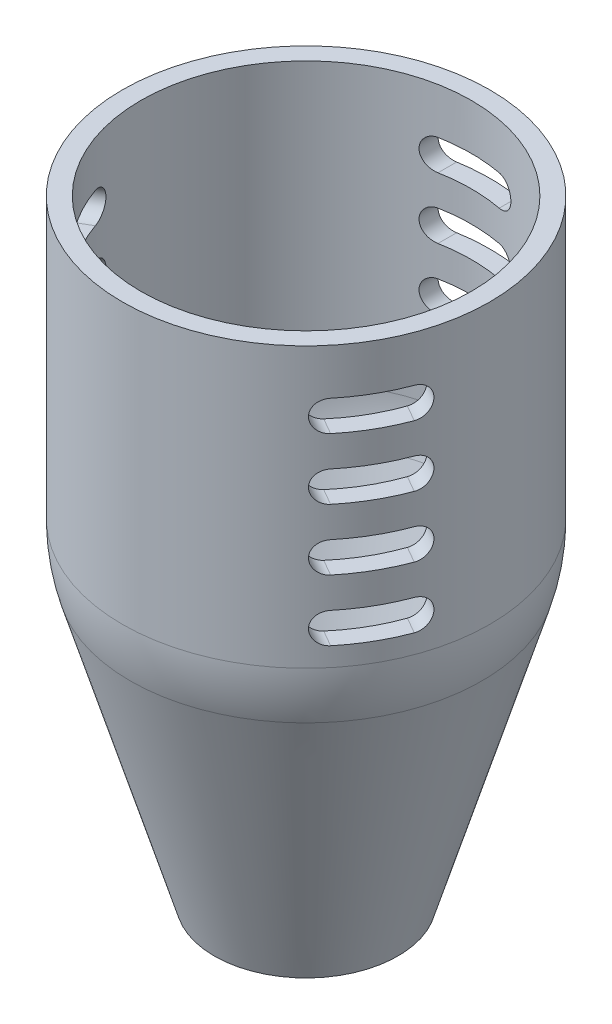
from build123d import *

# Parameters (mm, degrees)
VACIADO1_T            = -3
CORTAR_EXTRUIR1_DEPTH = 109.627804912
MATRIZL1_COUNT        = 4
MATRIZL1_PITCH        = 10
MATRIZC1_COUNT        = 3
MATRIZC1_COPY_1_DEPTH = 109.627804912
MATRIZC1_COPY_2_DEPTH = 109.627804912
MATRIZC1_COPY_3_DEPTH = 109.627804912
MATRIZC1_COPY_4_DEPTH = 109.627804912
MATRIZC1_COPY_5_DEPTH = 109.627804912
MATRIZC1_COPY_6_DEPTH = 109.627804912


with BuildPart() as part:
    # Croquis1 → Revoluci_n1 (revolve)
    with BuildSketch(Plane.XY, mode=Mode.PRIVATE) as revoluci_n1_sk:
        with BuildLine():
            Line((0, 0), (15, 0))
            Line((15, 0), (28.734788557, 45.782628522))
            ThreePointArc((28.734788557, 45.782628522), (29.682011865, 50.046670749), (30, 54.403065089))
            Line((30, 54.403065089), (30, 100))
            Line((30, 100), (0, 100))
            Line((0, 100), (0, 0))
        make_face()
    revolve(revoluci_n1_sk.sketch.rotate(Axis((0, 100, 0), (0, -1, 0)), 90), axis=Axis((0, 100, 0), (0, -1, 0)))

    # Vaciado1
    vaciado1_openings = [part.faces().sort_by_distance(p)[0] for p in [
        (0, 100, 0),
    ]]
    offset(amount=VACIADO1_T, openings=vaciado1_openings, kind=Kind.INTERSECTION)

    # Croquis2 → Cortar-Extruir1 (cut, through all)
    with BuildSketch(Plane.XY):
        with BuildLine():
            Line((-5, 62.5), (5, 62.5))
            ThreePointArc((5, 62.5), (7.5, 60), (5, 57.5))
            Line((5, 57.5), (-5, 57.5))
            ThreePointArc((-5, 57.5), (-7.5, 60), (-5, 62.5))
        make_face()
    cortar_extruir1 = extrude(amount=-CORTAR_EXTRUIR1_DEPTH, mode=Mode.SUBTRACT)

    # MatrizL1: Cortar-Extruir1 ×4
    with Locations(*[(0, i * MATRIZL1_PITCH, 0) for i in range(1, MATRIZL1_COUNT)]):
        add(cortar_extruir1, mode=Mode.SUBTRACT)

    # MatrizC1: Cortar-Extruir1 ×3 about axis
    matrizc1_axis = Axis((0, 100, 0), (0, 1, 0))
    for i in range(1, MATRIZC1_COUNT):
        add(cortar_extruir1.rotate(matrizc1_axis, i * 360 / MATRIZC1_COUNT), mode=Mode.SUBTRACT)

    # MatrizC1 copy 1 sketch → MatrizC1 copy 1 (cut, through all)
    with BuildSketch(Plane(origin=(0, 10, 0), x_dir=(-0.4999999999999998, 0, -0.8660254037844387), z_dir=(0.8660254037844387, 0, -0.4999999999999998))):
        with BuildLine():
            Line((-5, 62.5), (5, 62.5))
            ThreePointArc((5, 62.5), (7.5, 60), (5, 57.5))
            Line((5, 57.5), (-5, 57.5))
            ThreePointArc((-5, 57.5), (-7.5, 60), (-5, 62.5))
        make_face()
    extrude(amount=-MATRIZC1_COPY_1_DEPTH, mode=Mode.SUBTRACT)

    # MatrizC1 copy 2 sketch → MatrizC1 copy 2 (cut, through all)
    with BuildSketch(Plane(origin=(0, 10, 0), x_dir=(-0.5000000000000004, 0, 0.8660254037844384), z_dir=(-0.8660254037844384, 0, -0.5000000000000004))):
        with BuildLine():
            Line((-5, 62.5), (5, 62.5))
            ThreePointArc((5, 62.5), (7.5, 60), (5, 57.5))
            Line((5, 57.5), (-5, 57.5))
            ThreePointArc((-5, 57.5), (-7.5, 60), (-5, 62.5))
        make_face()
    extrude(amount=-MATRIZC1_COPY_2_DEPTH, mode=Mode.SUBTRACT)

    # MatrizC1 copy 3 sketch → MatrizC1 copy 3 (cut, through all)
    with BuildSketch(Plane(origin=(0, 20, 0), x_dir=(-0.4999999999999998, 0, -0.8660254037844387), z_dir=(0.8660254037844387, 0, -0.4999999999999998))):
        with BuildLine():
            Line((-5, 62.5), (5, 62.5))
            ThreePointArc((5, 62.5), (7.5, 60), (5, 57.5))
            Line((5, 57.5), (-5, 57.5))
            ThreePointArc((-5, 57.5), (-7.5, 60), (-5, 62.5))
        make_face()
    extrude(amount=-MATRIZC1_COPY_3_DEPTH, mode=Mode.SUBTRACT)

    # MatrizC1 copy 4 sketch → MatrizC1 copy 4 (cut, through all)
    with BuildSketch(Plane(origin=(0, 20, 0), x_dir=(-0.5000000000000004, 0, 0.8660254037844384), z_dir=(-0.8660254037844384, 0, -0.5000000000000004))):
        with BuildLine():
            Line((-5, 62.5), (5, 62.5))
            ThreePointArc((5, 62.5), (7.5, 60), (5, 57.5))
            Line((5, 57.5), (-5, 57.5))
            ThreePointArc((-5, 57.5), (-7.5, 60), (-5, 62.5))
        make_face()
    extrude(amount=-MATRIZC1_COPY_4_DEPTH, mode=Mode.SUBTRACT)

    # MatrizC1 copy 5 sketch → MatrizC1 copy 5 (cut, through all)
    with BuildSketch(Plane(origin=(0, 30, 0), x_dir=(-0.4999999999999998, 0, -0.8660254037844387), z_dir=(0.8660254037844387, 0, -0.4999999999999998))):
        with BuildLine():
            Line((-5, 62.5), (5, 62.5))
            ThreePointArc((5, 62.5), (7.5, 60), (5, 57.5))
            Line((5, 57.5), (-5, 57.5))
            ThreePointArc((-5, 57.5), (-7.5, 60), (-5, 62.5))
        make_face()
    extrude(amount=-MATRIZC1_COPY_5_DEPTH, mode=Mode.SUBTRACT)

    # MatrizC1 copy 6 sketch → MatrizC1 copy 6 (cut, through all)
    with BuildSketch(Plane(origin=(0, 30, 0), x_dir=(-0.5000000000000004, 0, 0.8660254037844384), z_dir=(-0.8660254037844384, 0, -0.5000000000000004))):
        with BuildLine():
            Line((-5, 62.5), (5, 62.5))
            ThreePointArc((5, 62.5), (7.5, 60), (5, 57.5))
            Line((5, 57.5), (-5, 57.5))
            ThreePointArc((-5, 57.5), (-7.5, 60), (-5, 62.5))
        make_face()
    extrude(amount=-MATRIZC1_COPY_6_DEPTH, mode=Mode.SUBTRACT)


solid = part.part
